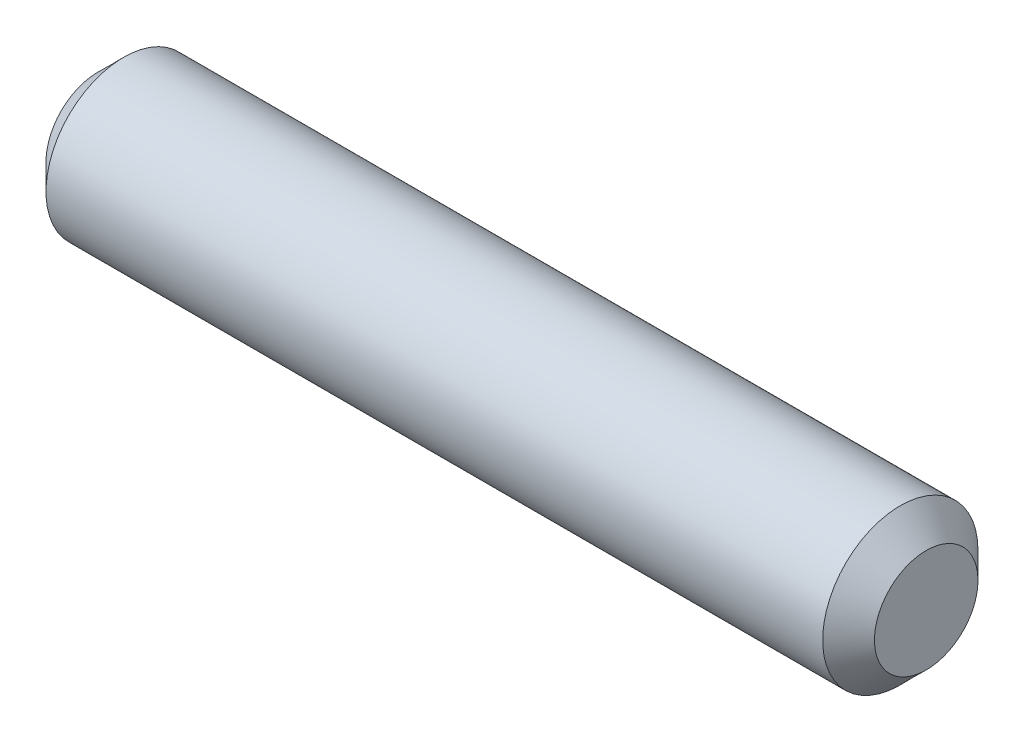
ISO-10303-21;
HEADER;
FILE_DESCRIPTION(('STEP AP214'),'2;1');
FILE_NAME('part.step','',(''),(''),'','','');
FILE_SCHEMA(('AUTOMOTIVE_DESIGN { 1 0 10303 214 1 1 1 1 }'));
ENDSEC;
DATA;
#1=APPLICATION_CONTEXT('core data for automotive mechanical design processes');
#2=APPLICATION_PROTOCOL_DEFINITION('international standard','automotive_design',2000,#1);
#3=PRODUCT_CONTEXT('',#1,'mechanical');
#4=PRODUCT('Part','Part','',(#3));
#5=PRODUCT_RELATED_PRODUCT_CATEGORY('part','',(#4));
#6=PRODUCT_DEFINITION_FORMATION('','',#4);
#7=PRODUCT_DEFINITION_CONTEXT('part definition',#1,'design');
#8=PRODUCT_DEFINITION('design','',#6,#7);
#9=PRODUCT_DEFINITION_SHAPE('','',#8);
#10=(LENGTH_UNIT() NAMED_UNIT(*) SI_UNIT(.MILLI.,.METRE.));
#11=(NAMED_UNIT(*) PLANE_ANGLE_UNIT() SI_UNIT($,.RADIAN.));
#12=(NAMED_UNIT(*) SI_UNIT($,.STERADIAN.) SOLID_ANGLE_UNIT());
#13=UNCERTAINTY_MEASURE_WITH_UNIT(LENGTH_MEASURE(1.E-05),#10,'distance_accuracy_value','');
#14=(GEOMETRIC_REPRESENTATION_CONTEXT(3) GLOBAL_UNCERTAINTY_ASSIGNED_CONTEXT((#13)) GLOBAL_UNIT_ASSIGNED_CONTEXT((#10,
#11,#12)) REPRESENTATION_CONTEXT('',''));
#15=CARTESIAN_POINT('',(0.,0.,0.));
#16=DIRECTION('',(0.,0.,1.));
#17=DIRECTION('',(1.,0.,0.));
#18=AXIS2_PLACEMENT_3D('',#15,#16,#17);
#19=CARTESIAN_POINT('',(16.,0.,0.));
#20=DIRECTION('',(-1.,0.,0.));
#21=DIRECTION('',(0.,0.,1.));
#22=AXIS2_PLACEMENT_3D('',#19,#20,#21);
#23=CYLINDRICAL_SURFACE('',#22,1.5);
#24=CARTESIAN_POINT('',(0.499999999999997,0.,0.));
#25=DIRECTION('',(1.,0.,0.));
#26=DIRECTION('',(0.,0.,-1.));
#27=AXIS2_PLACEMENT_3D('',#24,#25,#26);
#28=CIRCLE('',#27,1.5);
#29=CARTESIAN_POINT('',(0.499999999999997,0.,-1.5));
#30=VERTEX_POINT('',#29);
#31=EDGE_CURVE('E39',#30,#30,#28,.T.);
#32=ORIENTED_EDGE('',*,*,#31,.T.);
#33=EDGE_LOOP('',(#32));
#34=FACE_BOUND('',#33,.T.);
#35=CARTESIAN_POINT('',(15.5,0.,0.));
#36=DIRECTION('',(1.,0.,0.));
#37=DIRECTION('',(0.,0.,-1.));
#38=AXIS2_PLACEMENT_3D('',#35,#36,#37);
#39=CIRCLE('',#38,1.5);
#40=CARTESIAN_POINT('',(15.5,0.,-1.5));
#41=VERTEX_POINT('',#40);
#42=EDGE_CURVE('E43',#41,#41,#39,.F.);
#43=ORIENTED_EDGE('',*,*,#42,.T.);
#44=EDGE_LOOP('',(#43));
#45=FACE_BOUND('',#44,.T.);
#46=ADVANCED_FACE('F28',(#34,#45),#23,.T.);
#47=CARTESIAN_POINT('',(16.,0.,0.));
#48=DIRECTION('',(1.,0.,0.));
#49=DIRECTION('',(0.,0.,-1.));
#50=AXIS2_PLACEMENT_3D('',#47,#48,#49);
#51=PLANE('',#50);
#52=CARTESIAN_POINT('',(16.,0.,0.));
#53=DIRECTION('',(1.,0.,0.));
#54=DIRECTION('',(0.,0.,-1.));
#55=AXIS2_PLACEMENT_3D('',#52,#53,#54);
#56=CIRCLE('',#55,1.);
#57=CARTESIAN_POINT('',(16.,0.,-1.));
#58=VERTEX_POINT('',#57);
#59=EDGE_CURVE('E10',#58,#58,#56,.T.);
#60=ORIENTED_EDGE('',*,*,#59,.T.);
#61=EDGE_LOOP('',(#60));
#62=FACE_BOUND('',#61,.T.);
#63=ADVANCED_FACE('F59',(#62),#51,.T.);
#64=CARTESIAN_POINT('',(0.,0.,0.));
#65=DIRECTION('',(1.,0.,0.));
#66=DIRECTION('',(0.,0.,-1.));
#67=AXIS2_PLACEMENT_3D('',#64,#65,#66);
#68=PLANE('',#67);
#69=CARTESIAN_POINT('',(0.,0.,0.));
#70=DIRECTION('',(1.,0.,0.));
#71=DIRECTION('',(0.,0.,-1.));
#72=AXIS2_PLACEMENT_3D('',#69,#70,#71);
#73=CIRCLE('',#72,0.999999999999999);
#74=CARTESIAN_POINT('',(0.,0.,-0.999999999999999));
#75=VERTEX_POINT('',#74);
#76=EDGE_CURVE('E35',#75,#75,#73,.F.);
#77=ORIENTED_EDGE('',*,*,#76,.T.);
#78=EDGE_LOOP('',(#77));
#79=FACE_BOUND('',#78,.T.);
#80=ADVANCED_FACE('F56',(#79),#68,.F.);
#81=CARTESIAN_POINT('',(0.499999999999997,0.,0.));
#82=DIRECTION('',(1.,0.,0.));
#83=DIRECTION('',(0.,0.,-1.));
#84=AXIS2_PLACEMENT_3D('',#81,#82,#83);
#85=CONICAL_SURFACE('',#84,1.5,0.785398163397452);
#86=ORIENTED_EDGE('',*,*,#76,.F.);
#87=EDGE_LOOP('',(#86));
#88=FACE_BOUND('',#87,.T.);
#89=ORIENTED_EDGE('',*,*,#31,.F.);
#90=EDGE_LOOP('',(#89));
#91=FACE_BOUND('',#90,.T.);
#92=ADVANCED_FACE('F52',(#88,#91),#85,.T.);
#93=CARTESIAN_POINT('',(16.,0.,0.));
#94=DIRECTION('',(-1.,0.,0.));
#95=DIRECTION('',(0.,0.,1.));
#96=AXIS2_PLACEMENT_3D('',#93,#94,#95);
#97=CONICAL_SURFACE('',#96,1.,0.785398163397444);
#98=ORIENTED_EDGE('',*,*,#42,.F.);
#99=EDGE_LOOP('',(#98));
#100=FACE_BOUND('',#99,.T.);
#101=ORIENTED_EDGE('',*,*,#59,.F.);
#102=EDGE_LOOP('',(#101));
#103=FACE_BOUND('',#102,.T.);
#104=ADVANCED_FACE('F30',(#100,#103),#97,.T.);
#105=CLOSED_SHELL('',(#46,#63,#80,#92,#104));
#106=MANIFOLD_SOLID_BREP('B2',#105);
#107=ADVANCED_BREP_SHAPE_REPRESENTATION('',(#18,#106),#14);
#108=SHAPE_DEFINITION_REPRESENTATION(#9,#107);
ENDSEC;
END-ISO-10303-21;
